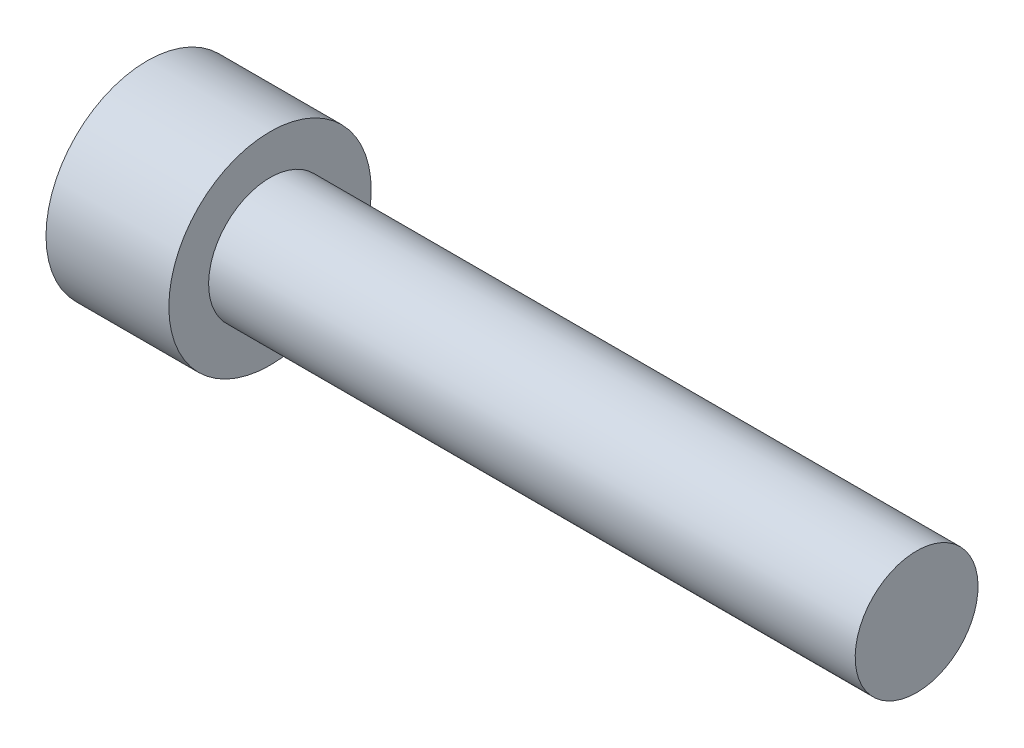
from build123d import *

# Parameters (mm, degrees)
CUT_EXTRUDE1_DEPTH = 2.54


with BuildPart() as part:
    # Sketch1 → Base-Revolve (revolve)
    with BuildSketch(Plane.XY, mode=Mode.PRIVATE) as base_revolve_sk:
        Polygon((4.826, 3.9751), (4.826, 2.413), (30.226, 2.413), (30.226, 0), (0, 0), (0, 3.9751), align=None)
    revolve(base_revolve_sk.sketch.rotate(Axis((0, 0, 0), (1, 0, 0)), 180), axis=Axis((0, 0, 0), (1, 0, 0)))

    # Sketch2 → Cut-Extrude1 (cut)
    with BuildSketch(Plane.ZY):
        Polygon((1.143846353, 1.9812), (2.287692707, 0), (1.143846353, -1.9812), (-1.143846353, -1.9812), (-2.287692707, 0), (-1.143846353, 1.9812), align=None)
    extrude(amount=-CUT_EXTRUDE1_DEPTH, mode=Mode.SUBTRACT)


solid = part.part
